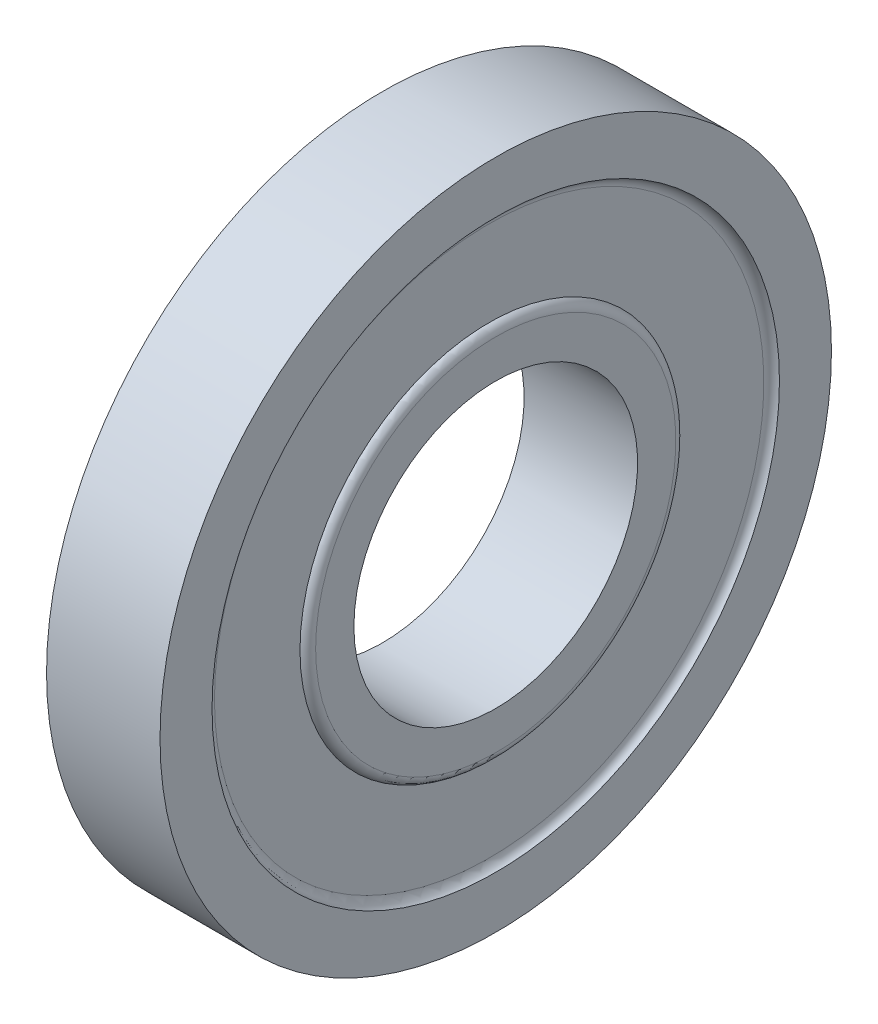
ISO-10303-21;
HEADER;
FILE_DESCRIPTION(('STEP AP214'),'2;1');
FILE_NAME('part.step','',(''),(''),'','','');
FILE_SCHEMA(('AUTOMOTIVE_DESIGN { 1 0 10303 214 1 1 1 1 }'));
ENDSEC;
DATA;
#1=APPLICATION_CONTEXT('core data for automotive mechanical design processes');
#2=APPLICATION_PROTOCOL_DEFINITION('international standard','automotive_design',2000,#1);
#3=PRODUCT_CONTEXT('',#1,'mechanical');
#4=PRODUCT('Part','Part','',(#3));
#5=PRODUCT_RELATED_PRODUCT_CATEGORY('part','',(#4));
#6=PRODUCT_DEFINITION_FORMATION('','',#4);
#7=PRODUCT_DEFINITION_CONTEXT('part definition',#1,'design');
#8=PRODUCT_DEFINITION('design','',#6,#7);
#9=PRODUCT_DEFINITION_SHAPE('','',#8);
#10=(LENGTH_UNIT() NAMED_UNIT(*) SI_UNIT(.MILLI.,.METRE.));
#11=(NAMED_UNIT(*) PLANE_ANGLE_UNIT() SI_UNIT($,.RADIAN.));
#12=(NAMED_UNIT(*) SI_UNIT($,.STERADIAN.) SOLID_ANGLE_UNIT());
#13=UNCERTAINTY_MEASURE_WITH_UNIT(LENGTH_MEASURE(1.E-05),#10,'distance_accuracy_value','');
#14=(GEOMETRIC_REPRESENTATION_CONTEXT(3) GLOBAL_UNCERTAINTY_ASSIGNED_CONTEXT((#13)) GLOBAL_UNIT_ASSIGNED_CONTEXT((#10,
#11,#12)) REPRESENTATION_CONTEXT('',''));
#15=CARTESIAN_POINT('',(0.,0.,0.));
#16=DIRECTION('',(0.,0.,1.));
#17=DIRECTION('',(1.,0.,0.));
#18=AXIS2_PLACEMENT_3D('',#15,#16,#17);
#19=CARTESIAN_POINT('',(-6.,15.,0.));
#20=DIRECTION('',(1.,0.,0.));
#21=DIRECTION('',(0.,0.,-1.));
#22=AXIS2_PLACEMENT_3D('',#19,#20,#21);
#23=PLANE('',#22);
#24=CARTESIAN_POINT('',(-6.,0.,0.));
#25=DIRECTION('',(1.,0.,0.));
#26=DIRECTION('',(0.,0.,-1.));
#27=AXIS2_PLACEMENT_3D('',#24,#25,#26);
#28=CIRCLE('',#27,19.046060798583);
#29=CARTESIAN_POINT('',(-6.,0.,-19.046060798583));
#30=VERTEX_POINT('',#29);
#31=EDGE_CURVE('E48',#30,#30,#28,.F.);
#32=ORIENTED_EDGE('',*,*,#31,.T.);
#33=EDGE_LOOP('',(#32));
#34=FACE_BOUND('',#33,.T.);
#35=CARTESIAN_POINT('',(-6.,0.,0.));
#36=DIRECTION('',(-1.,0.,0.));
#37=DIRECTION('',(0.,0.,1.));
#38=AXIS2_PLACEMENT_3D('',#35,#36,#37);
#39=CIRCLE('',#38,15.);
#40=CARTESIAN_POINT('',(-6.,0.,15.));
#41=VERTEX_POINT('',#40);
#42=EDGE_CURVE('E78',#41,#41,#39,.T.);
#43=ORIENTED_EDGE('',*,*,#42,.F.);
#44=EDGE_LOOP('',(#43));
#45=FACE_BOUND('',#44,.T.);
#46=ADVANCED_FACE('F37',(#34,#45),#23,.F.);
#47=CARTESIAN_POINT('',(-5.29999999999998,20.,0.));
#48=DIRECTION('',(1.,0.,0.));
#49=DIRECTION('',(0.,0.,-1.));
#50=AXIS2_PLACEMENT_3D('',#47,#48,#49);
#51=PLANE('',#50);
#52=CARTESIAN_POINT('',(-5.29999999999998,0.,0.));
#53=DIRECTION('',(1.,0.,0.));
#54=DIRECTION('',(0.,0.,-1.));
#55=AXIS2_PLACEMENT_3D('',#52,#53,#54);
#56=CIRCLE('',#55,29.0460607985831);
#57=CARTESIAN_POINT('',(-5.29999999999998,0.,-29.0460607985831));
#58=VERTEX_POINT('',#57);
#59=EDGE_CURVE('E52',#58,#58,#56,.F.);
#60=ORIENTED_EDGE('',*,*,#59,.T.);
#61=EDGE_LOOP('',(#60));
#62=FACE_BOUND('',#61,.T.);
#63=CARTESIAN_POINT('',(-5.29999999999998,0.,0.));
#64=DIRECTION('',(-1.,0.,0.));
#65=DIRECTION('',(0.,0.,1.));
#66=AXIS2_PLACEMENT_3D('',#63,#64,#65);
#67=CIRCLE('',#66,20.);
#68=CARTESIAN_POINT('',(-5.29999999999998,0.,20.));
#69=VERTEX_POINT('',#68);
#70=EDGE_CURVE('E57',#69,#69,#67,.T.);
#71=ORIENTED_EDGE('',*,*,#70,.F.);
#72=EDGE_LOOP('',(#71));
#73=FACE_BOUND('',#72,.T.);
#74=ADVANCED_FACE('F85',(#62,#73),#51,.F.);
#75=CARTESIAN_POINT('',(-5.99999999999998,30.,0.));
#76=DIRECTION('',(1.,0.,0.));
#77=DIRECTION('',(0.,0.,-1.));
#78=AXIS2_PLACEMENT_3D('',#75,#76,#77);
#79=PLANE('',#78);
#80=CARTESIAN_POINT('',(-5.99999999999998,0.,0.));
#81=DIRECTION('',(-1.,0.,0.));
#82=DIRECTION('',(0.,0.,1.));
#83=AXIS2_PLACEMENT_3D('',#80,#81,#82);
#84=CIRCLE('',#83,30.);
#85=CARTESIAN_POINT('',(-5.99999999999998,0.,30.));
#86=VERTEX_POINT('',#85);
#87=EDGE_CURVE('E60',#86,#86,#84,.T.);
#88=ORIENTED_EDGE('',*,*,#87,.F.);
#89=EDGE_LOOP('',(#88));
#90=FACE_BOUND('',#89,.T.);
#91=CARTESIAN_POINT('',(-5.99999999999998,0.,0.));
#92=DIRECTION('',(-1.,0.,0.));
#93=DIRECTION('',(0.,0.,1.));
#94=AXIS2_PLACEMENT_3D('',#91,#92,#93);
#95=CIRCLE('',#94,35.5);
#96=CARTESIAN_POINT('',(-5.99999999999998,0.,35.5));
#97=VERTEX_POINT('',#96);
#98=EDGE_CURVE('E63',#97,#97,#95,.T.);
#99=ORIENTED_EDGE('',*,*,#98,.T.);
#100=EDGE_LOOP('',(#99));
#101=FACE_BOUND('',#100,.T.);
#102=ADVANCED_FACE('F92',(#90,#101),#79,.F.);
#103=CARTESIAN_POINT('',(-14.540612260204,0.,0.));
#104=DIRECTION('',(-1.,0.,0.));
#105=DIRECTION('',(0.,0.,1.));
#106=AXIS2_PLACEMENT_3D('',#103,#104,#105);
#107=CYLINDRICAL_SURFACE('',#106,35.5);
#108=ORIENTED_EDGE('',*,*,#98,.F.);
#109=EDGE_LOOP('',(#108));
#110=FACE_BOUND('',#109,.T.);
#111=CARTESIAN_POINT('',(6.00000000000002,0.,0.));
#112=DIRECTION('',(-1.,0.,0.));
#113=DIRECTION('',(0.,0.,1.));
#114=AXIS2_PLACEMENT_3D('',#111,#112,#113);
#115=CIRCLE('',#114,35.5);
#116=CARTESIAN_POINT('',(6.00000000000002,0.,35.5));
#117=VERTEX_POINT('',#116);
#118=EDGE_CURVE('E66',#117,#117,#115,.T.);
#119=ORIENTED_EDGE('',*,*,#118,.T.);
#120=EDGE_LOOP('',(#119));
#121=FACE_BOUND('',#120,.T.);
#122=ADVANCED_FACE('F124',(#110,#121),#107,.T.);
#123=CARTESIAN_POINT('',(6.00000000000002,30.,0.));
#124=DIRECTION('',(-1.,0.,0.));
#125=DIRECTION('',(0.,0.,1.));
#126=AXIS2_PLACEMENT_3D('',#123,#124,#125);
#127=PLANE('',#126);
#128=ORIENTED_EDGE('',*,*,#118,.F.);
#129=EDGE_LOOP('',(#128));
#130=FACE_BOUND('',#129,.T.);
#131=CARTESIAN_POINT('',(6.00000000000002,0.,0.));
#132=DIRECTION('',(-1.,0.,0.));
#133=DIRECTION('',(0.,0.,1.));
#134=AXIS2_PLACEMENT_3D('',#131,#132,#133);
#135=CIRCLE('',#134,30.);
#136=CARTESIAN_POINT('',(6.00000000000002,0.,30.));
#137=VERTEX_POINT('',#136);
#138=EDGE_CURVE('E69',#137,#137,#135,.T.);
#139=ORIENTED_EDGE('',*,*,#138,.T.);
#140=EDGE_LOOP('',(#139));
#141=FACE_BOUND('',#140,.T.);
#142=ADVANCED_FACE('F117',(#130,#141),#127,.F.);
#143=CARTESIAN_POINT('',(5.30000000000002,20.,0.));
#144=DIRECTION('',(-1.,0.,0.));
#145=DIRECTION('',(0.,0.,1.));
#146=AXIS2_PLACEMENT_3D('',#143,#144,#145);
#147=PLANE('',#146);
#148=CARTESIAN_POINT('',(5.30000000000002,0.,0.));
#149=DIRECTION('',(-1.,0.,0.));
#150=DIRECTION('',(0.,0.,1.));
#151=AXIS2_PLACEMENT_3D('',#148,#149,#150);
#152=CIRCLE('',#151,29.0460607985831);
#153=CARTESIAN_POINT('',(5.30000000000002,0.,29.0460607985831));
#154=VERTEX_POINT('',#153);
#155=EDGE_CURVE('E10',#154,#154,#152,.F.);
#156=ORIENTED_EDGE('',*,*,#155,.T.);
#157=EDGE_LOOP('',(#156));
#158=FACE_BOUND('',#157,.T.);
#159=CARTESIAN_POINT('',(5.30000000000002,0.,0.));
#160=DIRECTION('',(-1.,0.,0.));
#161=DIRECTION('',(0.,0.,1.));
#162=AXIS2_PLACEMENT_3D('',#159,#160,#161);
#163=CIRCLE('',#162,20.);
#164=CARTESIAN_POINT('',(5.30000000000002,0.,20.));
#165=VERTEX_POINT('',#164);
#166=EDGE_CURVE('E72',#165,#165,#163,.T.);
#167=ORIENTED_EDGE('',*,*,#166,.T.);
#168=EDGE_LOOP('',(#167));
#169=FACE_BOUND('',#168,.T.);
#170=ADVANCED_FACE('F114',(#158,#169),#147,.F.);
#171=CARTESIAN_POINT('',(6.,15.,0.));
#172=DIRECTION('',(-1.,0.,0.));
#173=DIRECTION('',(0.,0.,1.));
#174=AXIS2_PLACEMENT_3D('',#171,#172,#173);
#175=PLANE('',#174);
#176=CARTESIAN_POINT('',(6.,0.,0.));
#177=DIRECTION('',(-1.,0.,0.));
#178=DIRECTION('',(0.,0.,1.));
#179=AXIS2_PLACEMENT_3D('',#176,#177,#178);
#180=CIRCLE('',#179,19.0460607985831);
#181=CARTESIAN_POINT('',(6.,0.,19.0460607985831));
#182=VERTEX_POINT('',#181);
#183=EDGE_CURVE('E44',#182,#182,#180,.F.);
#184=ORIENTED_EDGE('',*,*,#183,.T.);
#185=EDGE_LOOP('',(#184));
#186=FACE_BOUND('',#185,.T.);
#187=CARTESIAN_POINT('',(6.,0.,0.));
#188=DIRECTION('',(-1.,0.,0.));
#189=DIRECTION('',(0.,0.,1.));
#190=AXIS2_PLACEMENT_3D('',#187,#188,#189);
#191=CIRCLE('',#190,15.);
#192=CARTESIAN_POINT('',(6.,0.,15.));
#193=VERTEX_POINT('',#192);
#194=EDGE_CURVE('E75',#193,#193,#191,.T.);
#195=ORIENTED_EDGE('',*,*,#194,.T.);
#196=EDGE_LOOP('',(#195));
#197=FACE_BOUND('',#196,.T.);
#198=ADVANCED_FACE('F116',(#186,#197),#175,.F.);
#199=CARTESIAN_POINT('',(-14.540612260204,0.,0.));
#200=DIRECTION('',(-1.,0.,0.));
#201=DIRECTION('',(0.,0.,1.));
#202=AXIS2_PLACEMENT_3D('',#199,#200,#201);
#203=CYLINDRICAL_SURFACE('',#202,15.);
#204=ORIENTED_EDGE('',*,*,#194,.F.);
#205=EDGE_LOOP('',(#204));
#206=FACE_BOUND('',#205,.T.);
#207=ORIENTED_EDGE('',*,*,#42,.T.);
#208=EDGE_LOOP('',(#207));
#209=FACE_BOUND('',#208,.T.);
#210=ADVANCED_FACE('F82',(#206,#209),#203,.F.);
#211=CARTESIAN_POINT('',(-6.29999999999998,0.,0.));
#212=DIRECTION('',(-1.,0.,0.));
#213=DIRECTION('',(0.,0.,1.));
#214=AXIS2_PLACEMENT_3D('',#211,#212,#213);
#215=TOROIDAL_SURFACE('',#214,29.0460607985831,1.);
#216=ORIENTED_EDGE('',*,*,#87,.T.);
#217=EDGE_LOOP('',(#216));
#218=FACE_BOUND('',#217,.T.);
#219=ORIENTED_EDGE('',*,*,#59,.F.);
#220=EDGE_LOOP('',(#219));
#221=FACE_BOUND('',#220,.T.);
#222=ADVANCED_FACE('F97',(#218,#221),#215,.F.);
#223=CARTESIAN_POINT('',(-5.,0.,0.));
#224=DIRECTION('',(-1.,0.,0.));
#225=DIRECTION('',(0.,0.,1.));
#226=AXIS2_PLACEMENT_3D('',#223,#224,#225);
#227=TOROIDAL_SURFACE('',#226,19.046060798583,1.);
#228=ORIENTED_EDGE('',*,*,#70,.T.);
#229=EDGE_LOOP('',(#228));
#230=FACE_BOUND('',#229,.T.);
#231=ORIENTED_EDGE('',*,*,#31,.F.);
#232=EDGE_LOOP('',(#231));
#233=FACE_BOUND('',#232,.T.);
#234=ADVANCED_FACE('F100',(#230,#233),#227,.T.);
#235=CARTESIAN_POINT('',(5.,0.,0.));
#236=DIRECTION('',(1.,0.,0.));
#237=DIRECTION('',(0.,0.,-1.));
#238=AXIS2_PLACEMENT_3D('',#235,#236,#237);
#239=TOROIDAL_SURFACE('',#238,19.0460607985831,1.);
#240=ORIENTED_EDGE('',*,*,#183,.F.);
#241=EDGE_LOOP('',(#240));
#242=FACE_BOUND('',#241,.T.);
#243=ORIENTED_EDGE('',*,*,#166,.F.);
#244=EDGE_LOOP('',(#243));
#245=FACE_BOUND('',#244,.T.);
#246=ADVANCED_FACE('F103',(#242,#245),#239,.T.);
#247=CARTESIAN_POINT('',(6.30000000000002,0.,0.));
#248=DIRECTION('',(1.,0.,0.));
#249=DIRECTION('',(0.,0.,-1.));
#250=AXIS2_PLACEMENT_3D('',#247,#248,#249);
#251=TOROIDAL_SURFACE('',#250,29.0460607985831,1.);
#252=ORIENTED_EDGE('',*,*,#155,.F.);
#253=EDGE_LOOP('',(#252));
#254=FACE_BOUND('',#253,.T.);
#255=ORIENTED_EDGE('',*,*,#138,.F.);
#256=EDGE_LOOP('',(#255));
#257=FACE_BOUND('',#256,.T.);
#258=ADVANCED_FACE('F39',(#254,#257),#251,.F.);
#259=CLOSED_SHELL('',(#46,#74,#102,#122,#142,#170,#198,#210,#222,#234,#246,#258));
#260=MANIFOLD_SOLID_BREP('B2',#259);
#261=ADVANCED_BREP_SHAPE_REPRESENTATION('',(#18,#260),#14);
#262=SHAPE_DEFINITION_REPRESENTATION(#9,#261);
ENDSEC;
END-ISO-10303-21;
